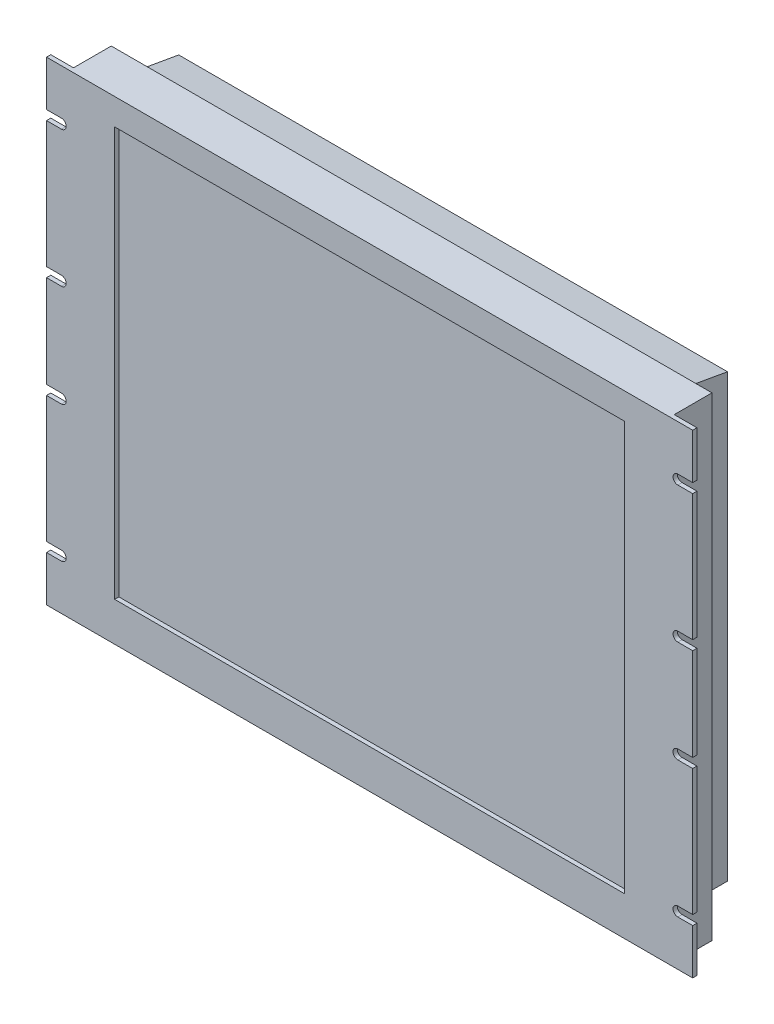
from build123d import *

# Parameters (mm, degrees)
SKETCH1_W           = 380.8476
SKETCH1_H           = 305.6128
BOSS_EXTRUDE1_DEPTH = 3.175
SKETCH2_W           = 448.6656
SKETCH2_H           = 354.33
BOSS_EXTRUDE2_DEPTH = 28.194
BOSS_EXTRUDE3_DEPTH = 30.988
DRAFT3_ANGLE        = 10
SKETCH4_R           = 1.9812
SKETCH4_R_2         = 7.1374
BOSS_EXTRUDE4_DEPTH = 0.508
SKETCH5_W           = 2.54
SKETCH5_H           = 12.7
CUT_EXTRUDE1_DEPTH  = 1.524


with BuildPart() as part:
    # Sketch1 → Boss-Extrude1 (new body)
    with BuildSketch(Plane.XY):
        with BuildLine():
            Line((241.3, 177.165), (-241.3, 177.165))
            Line((-241.3, 177.165), (-241.3, 143.256))
            Line((-241.3, 143.256), (-230.175929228, 143.256))
            ThreePointArc((-230.175929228, 143.256), (-226.619929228, 139.7), (-230.175929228, 136.144))
            Line((-230.175929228, 136.144), (-241.3, 136.144))
            Line((-241.3, 136.144), (-241.3, 41.656))
            Line((-241.3, 41.656), (-230.175929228, 41.656))
            ThreePointArc((-230.175929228, 41.656), (-226.619929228, 38.1), (-230.175929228, 34.544))
            Line((-230.175929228, 34.544), (-241.3, 34.544))
            Line((-241.3, 34.544), (-241.3, -34.544))
            Line((-241.3, -34.544), (-230.175929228, -34.544))
            ThreePointArc((-230.175929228, -34.544), (-226.619929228, -38.1), (-230.175929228, -41.656))
            Line((-230.175929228, -41.656), (-241.3, -41.656))
            Line((-241.3, -41.656), (-241.3, -136.144))
            Line((-241.3, -136.144), (-230.175929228, -136.144))
            ThreePointArc((-230.175929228, -136.144), (-226.619929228, -139.7), (-230.175929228, -143.256))
            Line((-230.175929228, -143.256), (-241.3, -143.256))
            Line((-241.3, -143.256), (-241.3, -177.165))
            Line((-241.3, -177.165), (241.3, -177.165))
            Line((241.3, -177.165), (241.3, -143.256))
            Line((241.3, -143.256), (230.175929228, -143.256))
            ThreePointArc((230.175929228, -143.256), (226.619929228, -139.7), (230.175929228, -136.144))
            Line((230.175929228, -136.144), (241.3, -136.144))
            Line((241.3, -136.144), (241.3, -41.656))
            Line((241.3, -41.656), (230.175929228, -41.656))
            ThreePointArc((230.175929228, -41.656), (226.619929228, -38.1), (230.175929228, -34.544))
            Line((230.175929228, -34.544), (241.3, -34.544))
            Line((241.3, -34.544), (241.3, 34.544))
            Line((241.3, 34.544), (230.175929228, 34.544))
            ThreePointArc((230.175929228, 34.544), (226.619929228, 38.1), (230.175929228, 41.656))
            Line((230.175929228, 41.656), (241.3, 41.656))
            Line((241.3, 41.656), (241.3, 136.144))
            Line((241.3, 136.144), (230.175929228, 136.144))
            ThreePointArc((230.175929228, 136.144), (226.619929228, 139.7), (230.175929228, 143.256))
            Line((230.175929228, 143.256), (241.3, 143.256))
            Line((241.3, 143.256), (241.3, 177.165))
        make_face()
        with Locations((0, 4.699)):
            Rectangle(SKETCH1_W, SKETCH1_H, mode=Mode.SUBTRACT)
    extrude(amount=BOSS_EXTRUDE1_DEPTH)

    # Sketch2 → Boss-Extrude2 (add)
    with BuildSketch(Plane(origin=(0, 0, 0), x_dir=(-1, 0, 0), z_dir=(0, 0, -1))):
        Rectangle(SKETCH2_W, SKETCH2_H)
    extrude(amount=BOSS_EXTRUDE2_DEPTH)

    # Sketch3 → Boss-Extrude3 (add)
    with BuildSketch(Plane(origin=(0, 0, -28.194), x_dir=(-1, 0, 0), z_dir=(0, 0, -1))):
        Polygon((-204.920919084, -163.905586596), (-204.920919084, 171.069), (204.920919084, 171.069), (204.920919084, -52.458132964), (-21.59072349, -52.458132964), (-21.59072349, -163.905586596), align=None)
    extrude(amount=BOSS_EXTRUDE3_DEPTH)

    # Draft3
    draft3_faces = [part.faces().sort_by_distance(p)[0] for p in [
        (0, 171.069, -43.688),
    ]]
    draft(draft3_faces, Plane(origin=(0, 0, -28.194), x_dir=(-1, 0, 0), z_dir=(0, 0, -1)), DRAFT3_ANGLE)

    # Sketch4 → Boss-Extrude4 (add)
    with BuildSketch(Plane(origin=(0, 0, -59.182), x_dir=(-1, 0, 0), z_dir=(0, 0, -1))):
        with Locations(Location((130.562565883, 132.616637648, 0), (0, 0, 180))):
            Circle(SKETCH4_R)
        with Locations(Location((98.800876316, 132.616637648, 0), (0, 0, 180))):
            Circle(SKETCH4_R_2)
        with Locations(Location((80.766876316, 132.616637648, 0), (0, 0, 180))):
            Circle(SKETCH4_R_2)
        with Locations(Location((62.732876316, 132.616637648, 0), (0, 0, 180))):
            Circle(SKETCH4_R_2)
        with Locations(Location((44.698876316, 132.616637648, 0), (0, 0, 180))):
            Circle(SKETCH4_R_2)
        with Locations(Location((116.834876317, 132.616637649, 0), (0, 0, 180))):
            Circle(SKETCH4_R_2)
    extrude(amount=BOSS_EXTRUDE4_DEPTH)

    # Sketch5 → Cut-Extrude1 (cut)
    with BuildSketch(Plane(origin=(0, 0, -59.182), x_dir=(-1, 0, 0), z_dir=(0, 0, -1))):
        with Locations((-167.294068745, -126.753132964)):
            Rectangle(SKETCH5_W, SKETCH5_H)
        with Locations((-160.944068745, -126.753132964)):
            Rectangle(SKETCH5_W, SKETCH5_H)
        with Locations((-154.594068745, -126.753132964)):
            Rectangle(SKETCH5_W, SKETCH5_H)
        with Locations((-148.244068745, -126.753132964)):
            Rectangle(SKETCH5_W, SKETCH5_H)
        with Locations((-141.894068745, -126.753132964)):
            Rectangle(SKETCH5_W, SKETCH5_H)
        with Locations((-135.544068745, -126.753132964)):
            Rectangle(SKETCH5_W, SKETCH5_H)
        with Locations((-129.194068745, -126.753132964)):
            Rectangle(SKETCH5_W, SKETCH5_H)
        with Locations((-122.844068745, -126.753132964)):
            Rectangle(SKETCH5_W, SKETCH5_H)
        with Locations((-173.644068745, -126.753132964)):
            Rectangle(SKETCH5_W, SKETCH5_H)
        with Locations((-179.994068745, -126.753132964)):
            Rectangle(SKETCH5_W, SKETCH5_H)
        with Locations((-186.344068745, -126.753132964)):
            Rectangle(SKETCH5_W, SKETCH5_H)
        with Locations((-167.294068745, -145.803132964)):
            Rectangle(SKETCH5_W, SKETCH5_H)
        with Locations((-160.944068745, -145.803132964)):
            Rectangle(SKETCH5_W, SKETCH5_H)
        with Locations((-154.594068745, -145.803132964)):
            Rectangle(SKETCH5_W, SKETCH5_H)
        with Locations((-148.244068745, -145.803132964)):
            Rectangle(SKETCH5_W, SKETCH5_H)
        with Locations((-141.894068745, -145.803132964)):
            Rectangle(SKETCH5_W, SKETCH5_H)
        with Locations((-135.544068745, -145.803132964)):
            Rectangle(SKETCH5_W, SKETCH5_H)
        with Locations((-129.194068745, -145.803132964)):
            Rectangle(SKETCH5_W, SKETCH5_H)
        with Locations((-122.844068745, -145.803132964)):
            Rectangle(SKETCH5_W, SKETCH5_H)
        with Locations((-173.644068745, -145.803132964)):
            Rectangle(SKETCH5_W, SKETCH5_H)
        with Locations((-179.994068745, -145.803132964)):
            Rectangle(SKETCH5_W, SKETCH5_H)
        with Locations((-186.344068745, -145.803132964)):
            Rectangle(SKETCH5_W, SKETCH5_H)
        with Locations((-116.494068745, -126.753132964)):
            Rectangle(SKETCH5_W, SKETCH5_H)
        with Locations((-110.144068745, -126.753132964)):
            Rectangle(SKETCH5_W, SKETCH5_H)
        with Locations((-116.494068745, -145.803132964)):
            Rectangle(SKETCH5_W, SKETCH5_H)
        with Locations((-110.144068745, -145.803132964)):
            Rectangle(SKETCH5_W, SKETCH5_H)
        with Locations((-103.794068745, -126.753132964)):
            Rectangle(SKETCH5_W, SKETCH5_H)
        with Locations((-103.794068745, -145.803132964)):
            Rectangle(SKETCH5_W, SKETCH5_H)
    extrude(amount=-CUT_EXTRUDE1_DEPTH, mode=Mode.SUBTRACT)


solid = part.part
